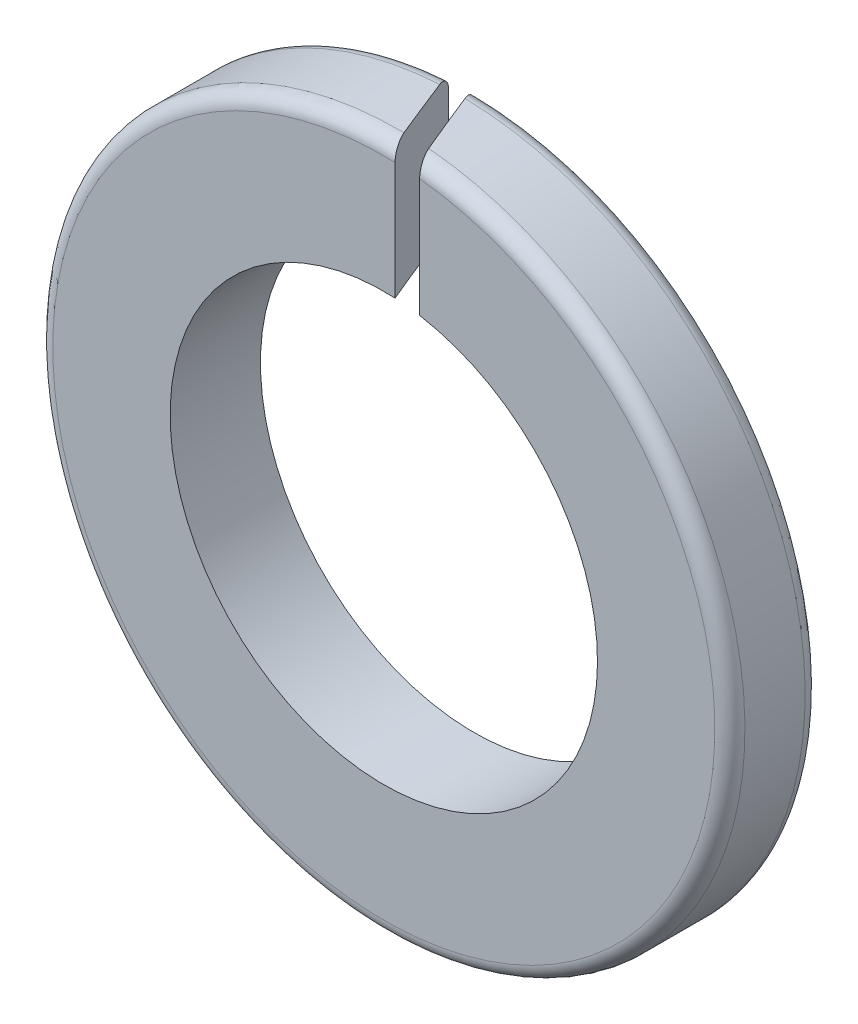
from build123d import *

# Parameters (mm, degrees)
ESQUISSE1_R             = 11.5
ESQUISSE1_R_2           = 7.1
EXTRUSION1_DEPTH        = 3
CONG_2_R                = 0.5
ENL_V_MAT_EXTRU_1_DEPTH = 17.537835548


with BuildPart() as part:
    # Esquisse1 → Extrusion1 (new body)
    with BuildSketch(Plane.XY):
        Circle(ESQUISSE1_R)
        Circle(ESQUISSE1_R_2, mode=Mode.SUBTRACT)
    extrude(amount=EXTRUSION1_DEPTH)

    # Cong_2
    cong_2_edges = [part.edges().sort_by_distance(p)[0] for p in [
        (-11.5, 0, 0),
        (-11.5, 0, 3),
    ]]
    fillet(cong_2_edges, radius=CONG_2_R)

    # Esquisse2 → Enl_v. mat.-Extru.1 (cut, through all)
    with BuildSketch(Plane(origin=(0, 0, 0), x_dir=(1, 0, 0), z_dir=(0, 1, 0))):
        Polygon((-0.862634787, 2.166197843), (1.536568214, -3.872245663), (0.727848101, -3.872245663), (-1.725269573, 2.166197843), align=None)
    extrude(amount=ENL_V_MAT_EXTRU_1_DEPTH, mode=Mode.SUBTRACT)


solid = part.part
